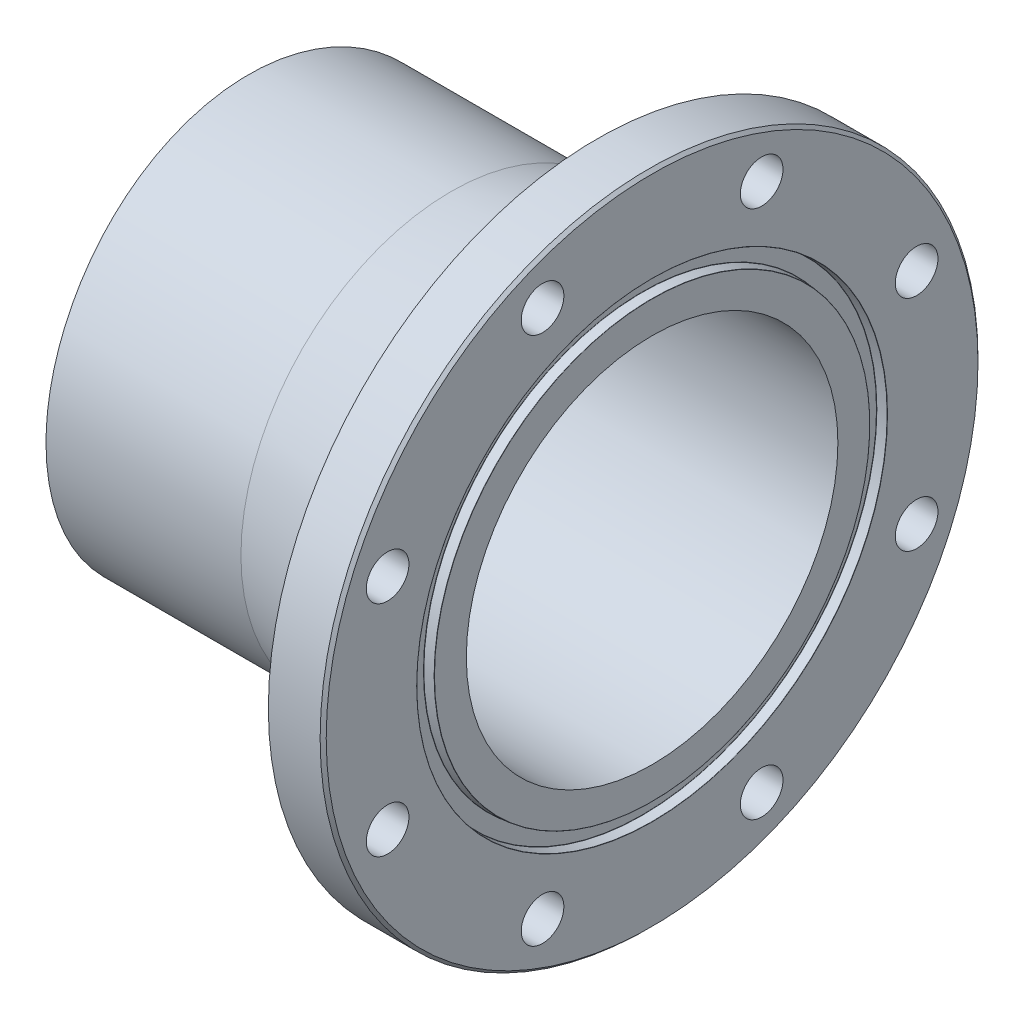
from build123d import *

# Parameters (mm, degrees)
SKETCH2_R          = 1524
CUT_EXTRUDE1_DEPTH = 139.7
CIRPATTERN1_COUNT  = 8
FILLET1_R          = 9.525
CHAMFER1_SIZE      = 1.5875


with BuildPart() as part:
    # Sketch1 → Revolve1 (revolve)
    with BuildSketch(Plane(origin=(0, 0, 0), x_dir=(1, 0, 0), z_dir=(0, 1, 0)), mode=Mode.PRIVATE) as revolve1_sk:
        with BuildLine():
            Line((0, 96.8375), (219.075, 96.8375))
            Line((219.075, 96.8375), (219.075, 113.419461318))
            ThreePointArc((219.075, 113.419461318), (219.041634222, 113.505261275), (218.959068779, 113.545978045))
            Line((218.959068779, 113.545978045), (214.085531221, 113.972357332))
            ThreePointArc((214.085531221, 113.972357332), (214.002965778, 114.013074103), (213.9696, 114.098874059))
            Line((213.9696, 114.098874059), (213.9696, 122.044925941))
            ThreePointArc((213.9696, 122.044925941), (214.002965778, 122.130725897), (214.085531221, 122.171442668))
            Line((214.085531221, 122.171442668), (218.959068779, 122.597821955))
            ThreePointArc((218.959068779, 122.597821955), (219.041634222, 122.638538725), (219.075, 122.724338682))
            Line((219.075, 122.724338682), (219.075, 171.45))
            Line((219.075, 171.45), (190.5, 171.45))
            Line((190.5, 171.45), (190.5, 123.825))
            Line((190.5, 123.825), (114.3, 109.5375))
            Line((114.3, 109.5375), (0, 109.5375))
            Line((0, 109.5375), (0, 96.8375))
        make_face()
    revolve(revolve1_sk.sketch.rotate(Axis((0, 0, 0), (1, 0, 0)), 180), axis=Axis((0, 0, 0), (1, 0, 0)))

    # Sketch2 → Cut-Extrude1 (cut, symmetric)
    with BuildSketch(Plane.XY):
        with Locations((-1511.3, 0)):
            Circle(SKETCH2_R)
    extrude(amount=CUT_EXTRUDE1_DEPTH, both=True, mode=Mode.SUBTRACT)

    # Sketch4 → 7_8 _0.875_ Diameter Hole1 (revolve, cut)
    with BuildSketch(Plane(origin=(219.075, 57.105935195, 137.865923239), x_dir=(0, 0, -1), z_dir=(0, 1, 0))):
        Polygon((0, 0), (0, 82.877063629), (11.1125, 76.2), (11.1125, 0), align=None)
    f_7_8_0_875_diameter_hole1 = revolve(axis=Axis((225.425, 57.105935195, 137.865923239), (-1, 0, 0)), mode=Mode.SUBTRACT)

    # CirPattern1: 7_8 _0.875_ Diameter Hole1 ×8 about axis
    cirpattern1_axis = Axis((0, 0, 0), (1, 0, 0))
    for i in range(1, CIRPATTERN1_COUNT):
        add(f_7_8_0_875_diameter_hole1.rotate(cirpattern1_axis, i * 360 / CIRPATTERN1_COUNT), mode=Mode.SUBTRACT)

    # Fillet1
    fillet1_edges = [part.edges().sort_by_distance(p)[0] for p in [
        (190.5, 0, -123.825),
    ]]
    fillet(fillet1_edges, radius=FILLET1_R)

    # Chamfer1
    chamfer1_edges = [part.edges().sort_by_distance(p)[0] for p in [
        (219.075, 0, -171.45),
    ]]
    chamfer(chamfer1_edges, length=CHAMFER1_SIZE)


solid = part.part
